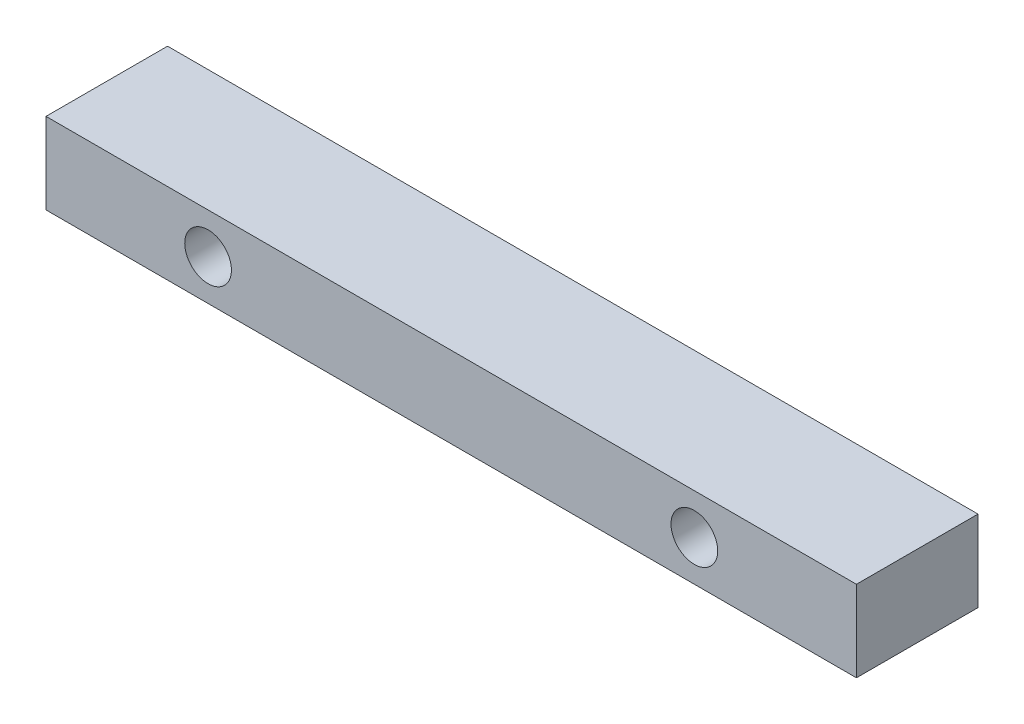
ISO-10303-21;
HEADER;
FILE_DESCRIPTION(('STEP AP214'),'2;1');
FILE_NAME('part.step','',(''),(''),'','','');
FILE_SCHEMA(('AUTOMOTIVE_DESIGN { 1 0 10303 214 1 1 1 1 }'));
ENDSEC;
DATA;
#1=APPLICATION_CONTEXT('core data for automotive mechanical design processes');
#2=APPLICATION_PROTOCOL_DEFINITION('international standard','automotive_design',2000,#1);
#3=PRODUCT_CONTEXT('',#1,'mechanical');
#4=PRODUCT('Part','Part','',(#3));
#5=PRODUCT_RELATED_PRODUCT_CATEGORY('part','',(#4));
#6=PRODUCT_DEFINITION_FORMATION('','',#4);
#7=PRODUCT_DEFINITION_CONTEXT('part definition',#1,'design');
#8=PRODUCT_DEFINITION('design','',#6,#7);
#9=PRODUCT_DEFINITION_SHAPE('','',#8);
#10=(LENGTH_UNIT() NAMED_UNIT(*) SI_UNIT(.MILLI.,.METRE.));
#11=(NAMED_UNIT(*) PLANE_ANGLE_UNIT() SI_UNIT($,.RADIAN.));
#12=(NAMED_UNIT(*) SI_UNIT($,.STERADIAN.) SOLID_ANGLE_UNIT());
#13=UNCERTAINTY_MEASURE_WITH_UNIT(LENGTH_MEASURE(1.E-05),#10,'distance_accuracy_value','');
#14=(GEOMETRIC_REPRESENTATION_CONTEXT(3) GLOBAL_UNCERTAINTY_ASSIGNED_CONTEXT((#13)) GLOBAL_UNIT_ASSIGNED_CONTEXT((#10,
#11,#12)) REPRESENTATION_CONTEXT('',''));
#15=CARTESIAN_POINT('',(0.,0.,0.));
#16=DIRECTION('',(0.,0.,1.));
#17=DIRECTION('',(1.,0.,0.));
#18=AXIS2_PLACEMENT_3D('',#15,#16,#17);
#19=CARTESIAN_POINT('',(0.,0.,9.525));
#20=DIRECTION('',(0.,0.,1.));
#21=DIRECTION('',(1.,0.,0.));
#22=AXIS2_PLACEMENT_3D('',#19,#20,#21);
#23=PLANE('',#22);
#24=CARTESIAN_POINT('',(-50.8,3.175,9.525));
#25=DIRECTION('',(0.,0.,1.));
#26=DIRECTION('',(1.,0.,0.));
#27=AXIS2_PLACEMENT_3D('',#24,#25,#26);
#28=CIRCLE('',#27,1.8288);
#29=CARTESIAN_POINT('',(-52.6288,3.175,9.525));
#30=VERTEX_POINT('',#29);
#31=EDGE_CURVE('E118',#30,#30,#28,.T.);
#32=ORIENTED_EDGE('',*,*,#31,.F.);
#33=EDGE_LOOP('',(#32));
#34=FACE_BOUND('',#33,.T.);
#35=DIRECTION('',(0.,1.,0.));
#36=VECTOR('',#35,1.);
#37=CARTESIAN_POINT('',(0.,0.,9.525));
#38=LINE('',#37,#36);
#39=CARTESIAN_POINT('',(0.,0.,9.525));
#40=VERTEX_POINT('',#39);
#41=CARTESIAN_POINT('',(0.,6.35,9.525));
#42=VERTEX_POINT('',#41);
#43=EDGE_CURVE('E96',#40,#42,#38,.T.);
#44=ORIENTED_EDGE('',*,*,#43,.T.);
#45=DIRECTION('',(-1.,0.,0.));
#46=VECTOR('',#45,1.);
#47=CARTESIAN_POINT('',(0.,6.35,9.525));
#48=LINE('',#47,#46);
#49=CARTESIAN_POINT('',(-63.5,6.34999999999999,9.525));
#50=VERTEX_POINT('',#49);
#51=EDGE_CURVE('E91',#42,#50,#48,.T.);
#52=ORIENTED_EDGE('',*,*,#51,.T.);
#53=DIRECTION('',(0.,-1.,0.));
#54=VECTOR('',#53,1.);
#55=CARTESIAN_POINT('',(-63.5,0.,9.525));
#56=LINE('',#55,#54);
#57=CARTESIAN_POINT('',(-63.5,0.,9.525));
#58=VERTEX_POINT('',#57);
#59=EDGE_CURVE('E94',#50,#58,#56,.T.);
#60=ORIENTED_EDGE('',*,*,#59,.T.);
#61=DIRECTION('',(1.,0.,0.));
#62=VECTOR('',#61,1.);
#63=CARTESIAN_POINT('',(0.,0.,9.525));
#64=LINE('',#63,#62);
#65=EDGE_CURVE('E61',#58,#40,#64,.T.);
#66=ORIENTED_EDGE('',*,*,#65,.T.);
#67=EDGE_LOOP('',(#44,#52,#60,#66));
#68=FACE_BOUND('',#67,.T.);
#69=CARTESIAN_POINT('',(-12.7,3.175,9.525));
#70=DIRECTION('',(0.,0.,1.));
#71=DIRECTION('',(-1.,0.,0.));
#72=AXIS2_PLACEMENT_3D('',#69,#70,#71);
#73=CIRCLE('',#72,1.8288);
#74=CARTESIAN_POINT('',(-14.5288,3.175,9.525));
#75=VERTEX_POINT('',#74);
#76=EDGE_CURVE('E144',#75,#75,#73,.T.);
#77=ORIENTED_EDGE('',*,*,#76,.F.);
#78=EDGE_LOOP('',(#77));
#79=FACE_BOUND('',#78,.T.);
#80=ADVANCED_FACE('F43',(#34,#68,#79),#23,.T.);
#81=CARTESIAN_POINT('',(0.,0.,0.));
#82=DIRECTION('',(0.,0.,1.));
#83=DIRECTION('',(1.,0.,0.));
#84=AXIS2_PLACEMENT_3D('',#81,#82,#83);
#85=PLANE('',#84);
#86=DIRECTION('',(0.,1.,0.));
#87=VECTOR('',#86,1.);
#88=CARTESIAN_POINT('',(0.,0.,0.));
#89=LINE('',#88,#87);
#90=CARTESIAN_POINT('',(0.,0.,0.));
#91=VERTEX_POINT('',#90);
#92=CARTESIAN_POINT('',(0.,6.35,0.));
#93=VERTEX_POINT('',#92);
#94=EDGE_CURVE('E114',#91,#93,#89,.T.);
#95=ORIENTED_EDGE('',*,*,#94,.F.);
#96=DIRECTION('',(1.,0.,0.));
#97=VECTOR('',#96,1.);
#98=CARTESIAN_POINT('',(0.,0.,0.));
#99=LINE('',#98,#97);
#100=CARTESIAN_POINT('',(-63.5,0.,0.));
#101=VERTEX_POINT('',#100);
#102=EDGE_CURVE('E84',#101,#91,#99,.T.);
#103=ORIENTED_EDGE('',*,*,#102,.F.);
#104=DIRECTION('',(0.,-1.,0.));
#105=VECTOR('',#104,1.);
#106=CARTESIAN_POINT('',(-63.5,0.,0.));
#107=LINE('',#106,#105);
#108=CARTESIAN_POINT('',(-63.5,6.34999999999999,0.));
#109=VERTEX_POINT('',#108);
#110=EDGE_CURVE('E78',#109,#101,#107,.T.);
#111=ORIENTED_EDGE('',*,*,#110,.F.);
#112=DIRECTION('',(-1.,0.,0.));
#113=VECTOR('',#112,1.);
#114=CARTESIAN_POINT('',(0.,6.35,0.));
#115=LINE('',#114,#113);
#116=EDGE_CURVE('E101',#93,#109,#115,.T.);
#117=ORIENTED_EDGE('',*,*,#116,.F.);
#118=EDGE_LOOP('',(#95,#103,#111,#117));
#119=FACE_BOUND('',#118,.T.);
#120=CARTESIAN_POINT('',(-50.8,3.175,0.));
#121=DIRECTION('',(0.,0.,1.));
#122=DIRECTION('',(1.,0.,0.));
#123=AXIS2_PLACEMENT_3D('',#120,#121,#122);
#124=CIRCLE('',#123,1.8288);
#125=CARTESIAN_POINT('',(-52.6288,3.175,0.));
#126=VERTEX_POINT('',#125);
#127=EDGE_CURVE('E140',#126,#126,#124,.T.);
#128=ORIENTED_EDGE('',*,*,#127,.T.);
#129=EDGE_LOOP('',(#128));
#130=FACE_BOUND('',#129,.T.);
#131=CARTESIAN_POINT('',(-12.7,3.175,0.));
#132=DIRECTION('',(0.,0.,1.));
#133=DIRECTION('',(-1.,0.,0.));
#134=AXIS2_PLACEMENT_3D('',#131,#132,#133);
#135=CIRCLE('',#134,1.8288);
#136=CARTESIAN_POINT('',(-14.5288,3.175,0.));
#137=VERTEX_POINT('',#136);
#138=EDGE_CURVE('E148',#137,#137,#135,.T.);
#139=ORIENTED_EDGE('',*,*,#138,.T.);
#140=EDGE_LOOP('',(#139));
#141=FACE_BOUND('',#140,.T.);
#142=ADVANCED_FACE('F133',(#119,#130,#141),#85,.F.);
#143=CARTESIAN_POINT('',(0.,0.,9.525));
#144=DIRECTION('',(-1.,0.,0.));
#145=DIRECTION('',(0.,0.,1.));
#146=AXIS2_PLACEMENT_3D('',#143,#144,#145);
#147=PLANE('',#146);
#148=ORIENTED_EDGE('',*,*,#94,.T.);
#149=DIRECTION('',(0.,0.,-1.));
#150=VECTOR('',#149,1.);
#151=CARTESIAN_POINT('',(0.,6.35,9.525));
#152=LINE('',#151,#150);
#153=EDGE_CURVE('E11',#42,#93,#152,.T.);
#154=ORIENTED_EDGE('',*,*,#153,.F.);
#155=ORIENTED_EDGE('',*,*,#43,.F.);
#156=DIRECTION('',(0.,0.,-1.));
#157=VECTOR('',#156,1.);
#158=CARTESIAN_POINT('',(0.,0.,9.525));
#159=LINE('',#158,#157);
#160=EDGE_CURVE('E110',#40,#91,#159,.T.);
#161=ORIENTED_EDGE('',*,*,#160,.T.);
#162=EDGE_LOOP('',(#148,#154,#155,#161));
#163=FACE_BOUND('',#162,.T.);
#164=ADVANCED_FACE('F45',(#163),#147,.F.);
#165=CARTESIAN_POINT('',(0.,6.35,9.525));
#166=DIRECTION('',(0.,-1.,0.));
#167=DIRECTION('',(1.,0.,0.));
#168=AXIS2_PLACEMENT_3D('',#165,#166,#167);
#169=PLANE('',#168);
#170=ORIENTED_EDGE('',*,*,#116,.T.);
#171=DIRECTION('',(0.,0.,-1.));
#172=VECTOR('',#171,1.);
#173=CARTESIAN_POINT('',(-63.5,6.34999999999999,9.525));
#174=LINE('',#173,#172);
#175=EDGE_CURVE('E53',#50,#109,#174,.T.);
#176=ORIENTED_EDGE('',*,*,#175,.F.);
#177=ORIENTED_EDGE('',*,*,#51,.F.);
#178=ORIENTED_EDGE('',*,*,#153,.T.);
#179=EDGE_LOOP('',(#170,#176,#177,#178));
#180=FACE_BOUND('',#179,.T.);
#181=ADVANCED_FACE('F100',(#180),#169,.F.);
#182=CARTESIAN_POINT('',(-63.5,0.,9.525));
#183=DIRECTION('',(1.,0.,0.));
#184=DIRECTION('',(0.,0.,-1.));
#185=AXIS2_PLACEMENT_3D('',#182,#183,#184);
#186=PLANE('',#185);
#187=ORIENTED_EDGE('',*,*,#110,.T.);
#188=DIRECTION('',(0.,0.,-1.));
#189=VECTOR('',#188,1.);
#190=CARTESIAN_POINT('',(-63.5,0.,9.525));
#191=LINE('',#190,#189);
#192=EDGE_CURVE('E103',#58,#101,#191,.T.);
#193=ORIENTED_EDGE('',*,*,#192,.F.);
#194=ORIENTED_EDGE('',*,*,#59,.F.);
#195=ORIENTED_EDGE('',*,*,#175,.T.);
#196=EDGE_LOOP('',(#187,#193,#194,#195));
#197=FACE_BOUND('',#196,.T.);
#198=ADVANCED_FACE('F104',(#197),#186,.F.);
#199=CARTESIAN_POINT('',(0.,0.,9.525));
#200=DIRECTION('',(0.,1.,0.));
#201=DIRECTION('',(0.,0.,1.));
#202=AXIS2_PLACEMENT_3D('',#199,#200,#201);
#203=PLANE('',#202);
#204=ORIENTED_EDGE('',*,*,#102,.T.);
#205=ORIENTED_EDGE('',*,*,#160,.F.);
#206=ORIENTED_EDGE('',*,*,#65,.F.);
#207=ORIENTED_EDGE('',*,*,#192,.T.);
#208=EDGE_LOOP('',(#204,#205,#206,#207));
#209=FACE_BOUND('',#208,.T.);
#210=ADVANCED_FACE('F130',(#209),#203,.F.);
#211=CARTESIAN_POINT('',(-50.8,3.175,9.525));
#212=DIRECTION('',(0.,0.,-1.));
#213=DIRECTION('',(-1.,0.,0.));
#214=AXIS2_PLACEMENT_3D('',#211,#212,#213);
#215=CYLINDRICAL_SURFACE('',#214,1.8288);
#216=CARTESIAN_POINT('',(-52.6288,3.175,9.525));
#217=CARTESIAN_POINT('',(-52.6288,3.175,9.42578125));
#218=CARTESIAN_POINT('',(-52.6288,3.175,9.3265625));
#219=CARTESIAN_POINT('',(-52.6288,3.175,9.128125));
#220=CARTESIAN_POINT('',(-52.6288,3.175,9.02890625));
#221=CARTESIAN_POINT('',(-52.6288,3.175,8.83046875));
#222=CARTESIAN_POINT('',(-52.6288,3.175,8.73125));
#223=CARTESIAN_POINT('',(-52.6288,3.175,8.5328125));
#224=CARTESIAN_POINT('',(-52.6288,3.175,8.43359375));
#225=CARTESIAN_POINT('',(-52.6288,3.175,8.23515625));
#226=CARTESIAN_POINT('',(-52.6288,3.175,8.1359375));
#227=CARTESIAN_POINT('',(-52.6288,3.175,7.9375));
#228=CARTESIAN_POINT('',(-52.6288,3.175,7.83828125));
#229=CARTESIAN_POINT('',(-52.6288,3.175,7.63984375));
#230=CARTESIAN_POINT('',(-52.6288,3.175,7.540625));
#231=CARTESIAN_POINT('',(-52.6288,3.175,7.3421875));
#232=CARTESIAN_POINT('',(-52.6288,3.175,7.24296875));
#233=CARTESIAN_POINT('',(-52.6288,3.175,7.04453125));
#234=CARTESIAN_POINT('',(-52.6288,3.175,6.9453125));
#235=CARTESIAN_POINT('',(-52.6288,3.175,6.746875));
#236=CARTESIAN_POINT('',(-52.6288,3.175,6.64765625));
#237=CARTESIAN_POINT('',(-52.6288,3.175,6.44921875));
#238=CARTESIAN_POINT('',(-52.6288,3.175,6.35));
#239=CARTESIAN_POINT('',(-52.6288,3.175,6.1515625));
#240=CARTESIAN_POINT('',(-52.6288,3.175,6.05234375));
#241=CARTESIAN_POINT('',(-52.6288,3.175,5.85390625));
#242=CARTESIAN_POINT('',(-52.6288,3.175,5.7546875));
#243=CARTESIAN_POINT('',(-52.6288,3.175,5.55625));
#244=CARTESIAN_POINT('',(-52.6288,3.175,5.45703125));
#245=CARTESIAN_POINT('',(-52.6288,3.175,5.25859375));
#246=CARTESIAN_POINT('',(-52.6288,3.175,5.159375));
#247=CARTESIAN_POINT('',(-52.6288,3.175,4.9609375));
#248=CARTESIAN_POINT('',(-52.6288,3.175,4.86171875));
#249=CARTESIAN_POINT('',(-52.6288,3.175,4.66328125));
#250=CARTESIAN_POINT('',(-52.6288,3.175,4.5640625));
#251=CARTESIAN_POINT('',(-52.6288,3.175,4.365625));
#252=CARTESIAN_POINT('',(-52.6288,3.175,4.26640625));
#253=CARTESIAN_POINT('',(-52.6288,3.175,4.06796875));
#254=CARTESIAN_POINT('',(-52.6288,3.175,3.96875));
#255=CARTESIAN_POINT('',(-52.6288,3.175,3.7703125));
#256=CARTESIAN_POINT('',(-52.6288,3.175,3.67109375));
#257=CARTESIAN_POINT('',(-52.6288,3.175,3.47265625));
#258=CARTESIAN_POINT('',(-52.6288,3.175,3.3734375));
#259=CARTESIAN_POINT('',(-52.6288,3.175,3.175));
#260=CARTESIAN_POINT('',(-52.6288,3.175,3.07578125));
#261=CARTESIAN_POINT('',(-52.6288,3.175,2.87734375));
#262=CARTESIAN_POINT('',(-52.6288,3.175,2.778125));
#263=CARTESIAN_POINT('',(-52.6288,3.175,2.5796875));
#264=CARTESIAN_POINT('',(-52.6288,3.175,2.48046875));
#265=CARTESIAN_POINT('',(-52.6288,3.175,2.28203125));
#266=CARTESIAN_POINT('',(-52.6288,3.175,2.1828125));
#267=CARTESIAN_POINT('',(-52.6288,3.175,1.984375));
#268=CARTESIAN_POINT('',(-52.6288,3.175,1.88515625));
#269=CARTESIAN_POINT('',(-52.6288,3.175,1.68671875));
#270=CARTESIAN_POINT('',(-52.6288,3.175,1.5875));
#271=CARTESIAN_POINT('',(-52.6288,3.175,1.3890625));
#272=CARTESIAN_POINT('',(-52.6288,3.175,1.28984375));
#273=CARTESIAN_POINT('',(-52.6288,3.175,1.09140625));
#274=CARTESIAN_POINT('',(-52.6288,3.175,0.992187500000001));
#275=CARTESIAN_POINT('',(-52.6288,3.175,0.793750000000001));
#276=CARTESIAN_POINT('',(-52.6288,3.175,0.69453125));
#277=CARTESIAN_POINT('',(-52.6288,3.175,0.49609375));
#278=CARTESIAN_POINT('',(-52.6288,3.175,0.396875));
#279=CARTESIAN_POINT('',(-52.6288,3.175,0.1984375));
#280=CARTESIAN_POINT('',(-52.6288,3.175,0.0992187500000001));
#281=CARTESIAN_POINT('',(-52.6288,3.175,0.));
#282=B_SPLINE_CURVE_WITH_KNOTS('',3,(#216,#217,#218,#219,#220,#221,#222,#223,#224,#225,#226,
#227,#228,#229,#230,#231,#232,#233,#234,#235,#236,#237,#238,#239,#240,#241,#242,#243,#244,#245,
#246,#247,#248,#249,#250,#251,#252,#253,#254,#255,#256,#257,#258,#259,#260,#261,#262,#263,#264,
#265,#266,#267,#268,#269,#270,#271,#272,#273,#274,#275,#276,#277,#278,#279,#280,#281),
.UNSPECIFIED.,.F.,.F.,(4,2,2,2,2,2,2,2,2,2,2,2,2,2,2,2,2,2,2,2,2,2,2,2,2,2,2,2,2,2,2,2,4),(0.,
0.297656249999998,0.595312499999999,0.892968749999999,1.190625,1.48828125,1.7859375,2.08359375,
2.38125,2.67890625,2.9765625,3.27421875,3.571875,3.86953125,4.1671875,4.46484375,4.7625,
5.06015625,5.3578125,5.65546875,5.953125,6.25078125,6.5484375,6.84609375,7.14375,7.44140625,
7.7390625,8.03671875,8.334375,8.63203125,8.9296875,9.22734375,9.525),.UNSPECIFIED.);
#283=EDGE_CURVE('BSEAM169',#30,#126,#282,.T.);
#284=ORIENTED_EDGE('',*,*,#31,.T.);
#285=ORIENTED_EDGE('',*,*,#127,.F.);
#286=ORIENTED_EDGE('',*,*,#283,.T.);
#287=ORIENTED_EDGE('',*,*,#283,.F.);
#288=EDGE_LOOP('',(#284,#286,#285,#287));
#289=FACE_BOUND('',#288,.T.);
#290=ADVANCED_FACE('F169',(#289),#215,.F.);
#291=CARTESIAN_POINT('',(-12.7,3.175,9.525));
#292=DIRECTION('',(0.,0.,-1.));
#293=DIRECTION('',(-1.,0.,0.));
#294=AXIS2_PLACEMENT_3D('',#291,#292,#293);
#295=CYLINDRICAL_SURFACE('',#294,1.8288);
#296=CARTESIAN_POINT('',(-14.5288,3.175,9.525));
#297=CARTESIAN_POINT('',(-14.5288,3.175,9.42578125));
#298=CARTESIAN_POINT('',(-14.5288,3.175,9.3265625));
#299=CARTESIAN_POINT('',(-14.5288,3.175,9.128125));
#300=CARTESIAN_POINT('',(-14.5288,3.175,9.02890625));
#301=CARTESIAN_POINT('',(-14.5288,3.175,8.83046875));
#302=CARTESIAN_POINT('',(-14.5288,3.175,8.73125));
#303=CARTESIAN_POINT('',(-14.5288,3.175,8.5328125));
#304=CARTESIAN_POINT('',(-14.5288,3.175,8.43359375));
#305=CARTESIAN_POINT('',(-14.5288,3.175,8.23515625));
#306=CARTESIAN_POINT('',(-14.5288,3.175,8.1359375));
#307=CARTESIAN_POINT('',(-14.5288,3.175,7.9375));
#308=CARTESIAN_POINT('',(-14.5288,3.175,7.83828125));
#309=CARTESIAN_POINT('',(-14.5288,3.175,7.63984375));
#310=CARTESIAN_POINT('',(-14.5288,3.175,7.540625));
#311=CARTESIAN_POINT('',(-14.5288,3.175,7.3421875));
#312=CARTESIAN_POINT('',(-14.5288,3.175,7.24296875));
#313=CARTESIAN_POINT('',(-14.5288,3.175,7.04453125));
#314=CARTESIAN_POINT('',(-14.5288,3.175,6.9453125));
#315=CARTESIAN_POINT('',(-14.5288,3.175,6.746875));
#316=CARTESIAN_POINT('',(-14.5288,3.175,6.64765625));
#317=CARTESIAN_POINT('',(-14.5288,3.175,6.44921875));
#318=CARTESIAN_POINT('',(-14.5288,3.175,6.35));
#319=CARTESIAN_POINT('',(-14.5288,3.175,6.1515625));
#320=CARTESIAN_POINT('',(-14.5288,3.175,6.05234375));
#321=CARTESIAN_POINT('',(-14.5288,3.175,5.85390625));
#322=CARTESIAN_POINT('',(-14.5288,3.175,5.7546875));
#323=CARTESIAN_POINT('',(-14.5288,3.175,5.55625));
#324=CARTESIAN_POINT('',(-14.5288,3.175,5.45703125));
#325=CARTESIAN_POINT('',(-14.5288,3.175,5.25859375));
#326=CARTESIAN_POINT('',(-14.5288,3.175,5.159375));
#327=CARTESIAN_POINT('',(-14.5288,3.175,4.9609375));
#328=CARTESIAN_POINT('',(-14.5288,3.175,4.86171875));
#329=CARTESIAN_POINT('',(-14.5288,3.175,4.66328125));
#330=CARTESIAN_POINT('',(-14.5288,3.175,4.5640625));
#331=CARTESIAN_POINT('',(-14.5288,3.175,4.365625));
#332=CARTESIAN_POINT('',(-14.5288,3.175,4.26640625));
#333=CARTESIAN_POINT('',(-14.5288,3.175,4.06796875));
#334=CARTESIAN_POINT('',(-14.5288,3.175,3.96875));
#335=CARTESIAN_POINT('',(-14.5288,3.175,3.7703125));
#336=CARTESIAN_POINT('',(-14.5288,3.175,3.67109375));
#337=CARTESIAN_POINT('',(-14.5288,3.175,3.47265625));
#338=CARTESIAN_POINT('',(-14.5288,3.175,3.3734375));
#339=CARTESIAN_POINT('',(-14.5288,3.175,3.175));
#340=CARTESIAN_POINT('',(-14.5288,3.175,3.07578125));
#341=CARTESIAN_POINT('',(-14.5288,3.175,2.87734375));
#342=CARTESIAN_POINT('',(-14.5288,3.175,2.778125));
#343=CARTESIAN_POINT('',(-14.5288,3.175,2.5796875));
#344=CARTESIAN_POINT('',(-14.5288,3.175,2.48046875));
#345=CARTESIAN_POINT('',(-14.5288,3.175,2.28203125));
#346=CARTESIAN_POINT('',(-14.5288,3.175,2.1828125));
#347=CARTESIAN_POINT('',(-14.5288,3.175,1.984375));
#348=CARTESIAN_POINT('',(-14.5288,3.175,1.88515625));
#349=CARTESIAN_POINT('',(-14.5288,3.175,1.68671875));
#350=CARTESIAN_POINT('',(-14.5288,3.175,1.5875));
#351=CARTESIAN_POINT('',(-14.5288,3.175,1.3890625));
#352=CARTESIAN_POINT('',(-14.5288,3.175,1.28984375));
#353=CARTESIAN_POINT('',(-14.5288,3.175,1.09140625));
#354=CARTESIAN_POINT('',(-14.5288,3.175,0.992187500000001));
#355=CARTESIAN_POINT('',(-14.5288,3.175,0.793750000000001));
#356=CARTESIAN_POINT('',(-14.5288,3.175,0.69453125));
#357=CARTESIAN_POINT('',(-14.5288,3.175,0.49609375));
#358=CARTESIAN_POINT('',(-14.5288,3.175,0.396875));
#359=CARTESIAN_POINT('',(-14.5288,3.175,0.1984375));
#360=CARTESIAN_POINT('',(-14.5288,3.175,0.0992187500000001));
#361=CARTESIAN_POINT('',(-14.5288,3.175,0.));
#362=B_SPLINE_CURVE_WITH_KNOTS('',3,(#296,#297,#298,#299,#300,#301,#302,#303,#304,#305,#306,
#307,#308,#309,#310,#311,#312,#313,#314,#315,#316,#317,#318,#319,#320,#321,#322,#323,#324,#325,
#326,#327,#328,#329,#330,#331,#332,#333,#334,#335,#336,#337,#338,#339,#340,#341,#342,#343,#344,
#345,#346,#347,#348,#349,#350,#351,#352,#353,#354,#355,#356,#357,#358,#359,#360,#361),
.UNSPECIFIED.,.F.,.F.,(4,2,2,2,2,2,2,2,2,2,2,2,2,2,2,2,2,2,2,2,2,2,2,2,2,2,2,2,2,2,2,2,4),(0.,
0.297656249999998,0.595312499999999,0.892968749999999,1.190625,1.48828125,1.7859375,2.08359375,
2.38125,2.67890625,2.9765625,3.27421875,3.571875,3.86953125,4.1671875,4.46484375,4.7625,
5.06015625,5.3578125,5.65546875,5.953125,6.25078125,6.5484375,6.84609375,7.14375,7.44140625,
7.7390625,8.03671875,8.334375,8.63203125,8.9296875,9.22734375,9.525),.UNSPECIFIED.);
#363=EDGE_CURVE('BSEAM158',#75,#137,#362,.T.);
#364=ORIENTED_EDGE('',*,*,#76,.T.);
#365=ORIENTED_EDGE('',*,*,#138,.F.);
#366=ORIENTED_EDGE('',*,*,#363,.T.);
#367=ORIENTED_EDGE('',*,*,#363,.F.);
#368=EDGE_LOOP('',(#364,#366,#365,#367));
#369=FACE_BOUND('',#368,.T.);
#370=ADVANCED_FACE('F158',(#369),#295,.F.);
#371=CLOSED_SHELL('',(#80,#142,#164,#181,#198,#210,#290,#370));
#372=MANIFOLD_SOLID_BREP('B2',#371);
#373=ADVANCED_BREP_SHAPE_REPRESENTATION('',(#18,#372),#14);
#374=SHAPE_DEFINITION_REPRESENTATION(#9,#373);
ENDSEC;
END-ISO-10303-21;
